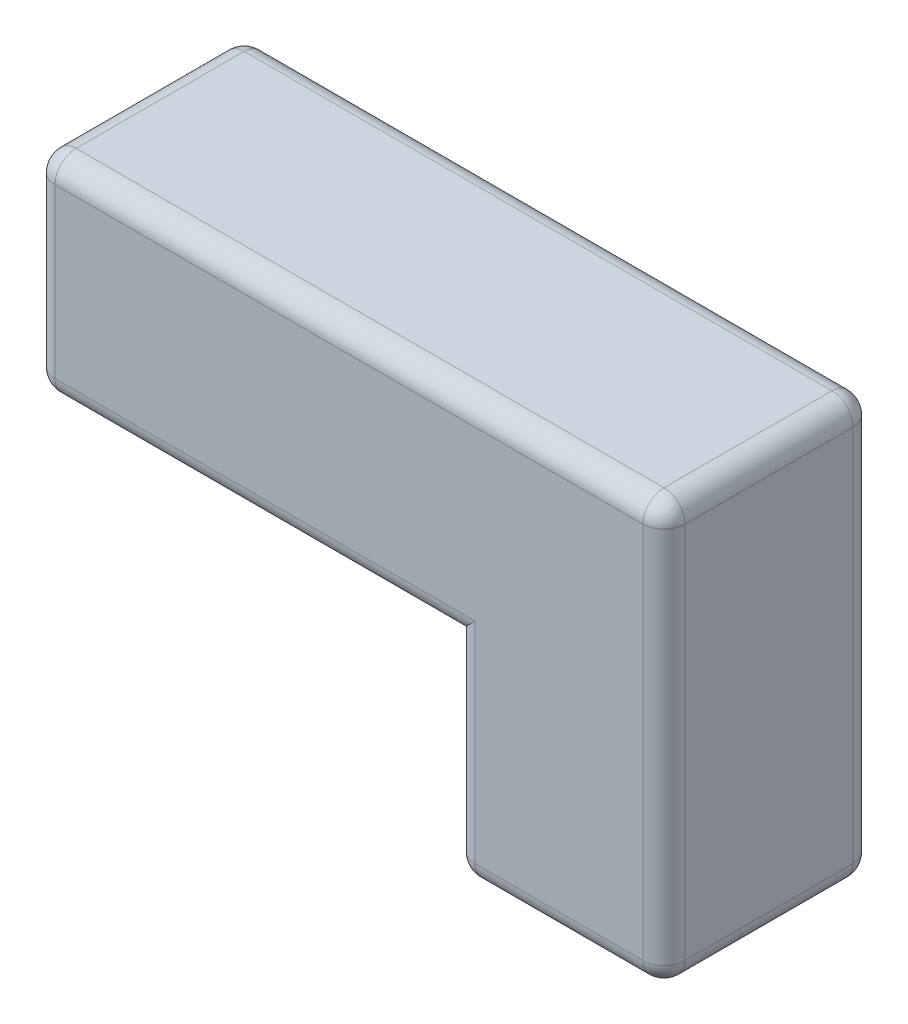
ISO-10303-21;
HEADER;
FILE_DESCRIPTION(('STEP AP214'),'2;1');
FILE_NAME('part.step','',(''),(''),'','','');
FILE_SCHEMA(('AUTOMOTIVE_DESIGN { 1 0 10303 214 1 1 1 1 }'));
ENDSEC;
DATA;
#1=APPLICATION_CONTEXT('core data for automotive mechanical design processes');
#2=APPLICATION_PROTOCOL_DEFINITION('international standard','automotive_design',2000,#1);
#3=PRODUCT_CONTEXT('',#1,'mechanical');
#4=PRODUCT('Part','Part','',(#3));
#5=PRODUCT_RELATED_PRODUCT_CATEGORY('part','',(#4));
#6=PRODUCT_DEFINITION_FORMATION('','',#4);
#7=PRODUCT_DEFINITION_CONTEXT('part definition',#1,'design');
#8=PRODUCT_DEFINITION('design','',#6,#7);
#9=PRODUCT_DEFINITION_SHAPE('','',#8);
#10=(LENGTH_UNIT() NAMED_UNIT(*) SI_UNIT(.MILLI.,.METRE.));
#11=(NAMED_UNIT(*) PLANE_ANGLE_UNIT() SI_UNIT($,.RADIAN.));
#12=(NAMED_UNIT(*) SI_UNIT($,.STERADIAN.) SOLID_ANGLE_UNIT());
#13=UNCERTAINTY_MEASURE_WITH_UNIT(LENGTH_MEASURE(1.E-05),#10,'distance_accuracy_value','');
#14=(GEOMETRIC_REPRESENTATION_CONTEXT(3) GLOBAL_UNCERTAINTY_ASSIGNED_CONTEXT((#13)) GLOBAL_UNIT_ASSIGNED_CONTEXT((#10,
#11,#12)) REPRESENTATION_CONTEXT('',''));
#15=CARTESIAN_POINT('',(0.,0.,0.));
#16=DIRECTION('',(0.,0.,1.));
#17=DIRECTION('',(1.,0.,0.));
#18=AXIS2_PLACEMENT_3D('',#15,#16,#17);
#19=CARTESIAN_POINT('',(-326.4,114.74031182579,100.));
#20=DIRECTION('',(1.,0.,0.));
#21=DIRECTION('',(0.,1.,0.));
#22=AXIS2_PLACEMENT_3D('',#19,#20,#21);
#23=PLANE('',#22);
#24=DIRECTION('',(0.,-1.,0.));
#25=VECTOR('',#24,1.);
#26=CARTESIAN_POINT('',(-326.4,114.74031182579,9.99999999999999));
#27=LINE('',#26,#25);
#28=CARTESIAN_POINT('',(-326.4,104.74031182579,9.99999999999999));
#29=VERTEX_POINT('',#28);
#30=CARTESIAN_POINT('',(-326.4,24.7403118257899,9.99999999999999));
#31=VERTEX_POINT('',#30);
#32=EDGE_CURVE('E216',#29,#31,#27,.T.);
#33=ORIENTED_EDGE('',*,*,#32,.T.);
#34=DIRECTION('',(0.,0.,-1.));
#35=VECTOR('',#34,1.);
#36=CARTESIAN_POINT('',(-326.4,24.7403118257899,100.));
#37=LINE('',#36,#35);
#38=CARTESIAN_POINT('',(-326.4,24.7403118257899,90.));
#39=VERTEX_POINT('',#38);
#40=EDGE_CURVE('E218',#31,#39,#37,.F.);
#41=ORIENTED_EDGE('',*,*,#40,.T.);
#42=DIRECTION('',(0.,-1.,0.));
#43=VECTOR('',#42,1.);
#44=CARTESIAN_POINT('',(-326.4,114.74031182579,90.));
#45=LINE('',#44,#43);
#46=CARTESIAN_POINT('',(-326.4,104.74031182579,90.));
#47=VERTEX_POINT('',#46);
#48=EDGE_CURVE('E212',#39,#47,#45,.F.);
#49=ORIENTED_EDGE('',*,*,#48,.T.);
#50=DIRECTION('',(0.,0.,-1.));
#51=VECTOR('',#50,1.);
#52=CARTESIAN_POINT('',(-326.4,104.74031182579,100.));
#53=LINE('',#52,#51);
#54=EDGE_CURVE('E214',#47,#29,#53,.T.);
#55=ORIENTED_EDGE('',*,*,#54,.T.);
#56=EDGE_LOOP('',(#33,#41,#49,#55));
#57=FACE_BOUND('',#56,.T.);
#58=ADVANCED_FACE('F37',(#57),#23,.F.);
#59=CARTESIAN_POINT('',(-326.4,14.7403118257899,100.));
#60=DIRECTION('',(0.,1.,0.));
#61=DIRECTION('',(-1.,0.,0.));
#62=AXIS2_PLACEMENT_3D('',#59,#60,#61);
#63=PLANE('',#62);
#64=DIRECTION('',(0.,0.,-1.));
#65=VECTOR('',#64,1.);
#66=CARTESIAN_POINT('',(-316.4,14.7403118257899,100.));
#67=LINE('',#66,#65);
#68=CARTESIAN_POINT('',(-316.4,14.7403118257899,90.));
#69=VERTEX_POINT('',#68);
#70=CARTESIAN_POINT('',(-316.4,14.7403118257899,9.99999999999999));
#71=VERTEX_POINT('',#70);
#72=EDGE_CURVE('E208',#69,#71,#67,.T.);
#73=ORIENTED_EDGE('',*,*,#72,.T.);
#74=DIRECTION('',(1.,0.,0.));
#75=VECTOR('',#74,1.);
#76=CARTESIAN_POINT('',(-326.4,14.7403118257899,9.99999999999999));
#77=LINE('',#76,#75);
#78=CARTESIAN_POINT('',(-126.4,14.7403118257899,9.99999999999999));
#79=VERTEX_POINT('',#78);
#80=EDGE_CURVE('E210',#71,#79,#77,.T.);
#81=ORIENTED_EDGE('',*,*,#80,.T.);
#82=DIRECTION('',(0.,0.,-1.));
#83=VECTOR('',#82,1.);
#84=CARTESIAN_POINT('',(-126.4,14.7403118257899,100.));
#85=LINE('',#84,#83);
#86=CARTESIAN_POINT('',(-126.4,14.7403118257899,90.));
#87=VERTEX_POINT('',#86);
#88=EDGE_CURVE('E191',#87,#79,#85,.T.);
#89=ORIENTED_EDGE('',*,*,#88,.F.);
#90=DIRECTION('',(1.,0.,0.));
#91=VECTOR('',#90,1.);
#92=CARTESIAN_POINT('',(-326.4,14.7403118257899,90.));
#93=LINE('',#92,#91);
#94=EDGE_CURVE('E206',#87,#69,#93,.F.);
#95=ORIENTED_EDGE('',*,*,#94,.T.);
#96=EDGE_LOOP('',(#73,#81,#89,#95));
#97=FACE_BOUND('',#96,.T.);
#98=ADVANCED_FACE('F433',(#97),#63,.F.);
#99=CARTESIAN_POINT('',(-126.4,14.7403118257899,100.));
#100=DIRECTION('',(1.,0.,0.));
#101=DIRECTION('',(0.,0.,-1.));
#102=AXIS2_PLACEMENT_3D('',#99,#100,#101);
#103=PLANE('',#102);
#104=ORIENTED_EDGE('',*,*,#88,.T.);
#105=DIRECTION('',(0.,-1.,0.));
#106=VECTOR('',#105,1.);
#107=CARTESIAN_POINT('',(-126.4,14.7403118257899,9.99999999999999));
#108=LINE('',#107,#106);
#109=CARTESIAN_POINT('',(-126.4,-75.2596881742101,9.99999999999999));
#110=VERTEX_POINT('',#109);
#111=EDGE_CURVE('E204',#79,#110,#108,.T.);
#112=ORIENTED_EDGE('',*,*,#111,.T.);
#113=DIRECTION('',(0.,0.,-1.));
#114=VECTOR('',#113,1.);
#115=CARTESIAN_POINT('',(-126.4,-75.2596881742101,100.));
#116=LINE('',#115,#114);
#117=CARTESIAN_POINT('',(-126.4,-75.2596881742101,90.));
#118=VERTEX_POINT('',#117);
#119=EDGE_CURVE('E201',#110,#118,#116,.F.);
#120=ORIENTED_EDGE('',*,*,#119,.T.);
#121=DIRECTION('',(0.,-1.,0.));
#122=VECTOR('',#121,1.);
#123=CARTESIAN_POINT('',(-126.4,14.7403118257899,90.));
#124=LINE('',#123,#122);
#125=EDGE_CURVE('E199',#118,#87,#124,.F.);
#126=ORIENTED_EDGE('',*,*,#125,.T.);
#127=EDGE_LOOP('',(#104,#112,#120,#126));
#128=FACE_BOUND('',#127,.T.);
#129=ADVANCED_FACE('F438',(#128),#103,.F.);
#130=CARTESIAN_POINT('',(-26.4,-85.2596881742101,100.));
#131=DIRECTION('',(0.,1.,0.));
#132=DIRECTION('',(-1.,0.,0.));
#133=AXIS2_PLACEMENT_3D('',#130,#131,#132);
#134=PLANE('',#133);
#135=DIRECTION('',(1.,0.,0.));
#136=VECTOR('',#135,1.);
#137=CARTESIAN_POINT('',(-126.4,-85.2596881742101,90.));
#138=LINE('',#137,#136);
#139=CARTESIAN_POINT('',(-36.4,-85.2596881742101,90.));
#140=VERTEX_POINT('',#139);
#141=CARTESIAN_POINT('',(-116.4,-85.2596881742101,90.));
#142=VERTEX_POINT('',#141);
#143=EDGE_CURVE('E159',#140,#142,#138,.F.);
#144=ORIENTED_EDGE('',*,*,#143,.T.);
#145=DIRECTION('',(0.,0.,-1.));
#146=VECTOR('',#145,1.);
#147=CARTESIAN_POINT('',(-116.4,-85.2596881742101,100.));
#148=LINE('',#147,#146);
#149=CARTESIAN_POINT('',(-116.4,-85.2596881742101,9.99999999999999));
#150=VERTEX_POINT('',#149);
#151=EDGE_CURVE('E197',#142,#150,#148,.T.);
#152=ORIENTED_EDGE('',*,*,#151,.T.);
#153=DIRECTION('',(1.,0.,0.));
#154=VECTOR('',#153,1.);
#155=CARTESIAN_POINT('',(-26.4,-85.2596881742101,9.99999999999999));
#156=LINE('',#155,#154);
#157=CARTESIAN_POINT('',(-36.4,-85.2596881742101,9.99999999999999));
#158=VERTEX_POINT('',#157);
#159=EDGE_CURVE('E162',#150,#158,#156,.T.);
#160=ORIENTED_EDGE('',*,*,#159,.T.);
#161=DIRECTION('',(0.,0.,-1.));
#162=VECTOR('',#161,1.);
#163=CARTESIAN_POINT('',(-36.4,-85.2596881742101,100.));
#164=LINE('',#163,#162);
#165=EDGE_CURVE('E154',#158,#140,#164,.F.);
#166=ORIENTED_EDGE('',*,*,#165,.T.);
#167=EDGE_LOOP('',(#144,#152,#160,#166));
#168=FACE_BOUND('',#167,.T.);
#169=ADVANCED_FACE('F156',(#168),#134,.F.);
#170=CARTESIAN_POINT('',(-26.4,114.74031182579,100.));
#171=DIRECTION('',(-1.,0.,0.));
#172=DIRECTION('',(0.,-1.,0.));
#173=AXIS2_PLACEMENT_3D('',#170,#171,#172);
#174=PLANE('',#173);
#175=DIRECTION('',(0.,1.,0.));
#176=VECTOR('',#175,1.);
#177=CARTESIAN_POINT('',(-26.4,-85.2596881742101,90.));
#178=LINE('',#177,#176);
#179=CARTESIAN_POINT('',(-26.4,104.74031182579,90.));
#180=VERTEX_POINT('',#179);
#181=CARTESIAN_POINT('',(-26.4,-75.2596881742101,90.));
#182=VERTEX_POINT('',#181);
#183=EDGE_CURVE('E234',#180,#182,#178,.F.);
#184=ORIENTED_EDGE('',*,*,#183,.T.);
#185=DIRECTION('',(0.,0.,-1.));
#186=VECTOR('',#185,1.);
#187=CARTESIAN_POINT('',(-26.4,-75.2596881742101,100.));
#188=LINE('',#187,#186);
#189=CARTESIAN_POINT('',(-26.4,-75.2596881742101,9.99999999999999));
#190=VERTEX_POINT('',#189);
#191=EDGE_CURVE('E173',#182,#190,#188,.T.);
#192=ORIENTED_EDGE('',*,*,#191,.T.);
#193=DIRECTION('',(0.,1.,0.));
#194=VECTOR('',#193,1.);
#195=CARTESIAN_POINT('',(-26.4,114.74031182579,9.99999999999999));
#196=LINE('',#195,#194);
#197=CARTESIAN_POINT('',(-26.4,104.74031182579,9.99999999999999));
#198=VERTEX_POINT('',#197);
#199=EDGE_CURVE('E238',#190,#198,#196,.T.);
#200=ORIENTED_EDGE('',*,*,#199,.T.);
#201=DIRECTION('',(0.,0.,-1.));
#202=VECTOR('',#201,1.);
#203=CARTESIAN_POINT('',(-26.4,104.74031182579,100.));
#204=LINE('',#203,#202);
#205=EDGE_CURVE('E236',#198,#180,#204,.F.);
#206=ORIENTED_EDGE('',*,*,#205,.T.);
#207=EDGE_LOOP('',(#184,#192,#200,#206));
#208=FACE_BOUND('',#207,.T.);
#209=ADVANCED_FACE('F358',(#208),#174,.F.);
#210=CARTESIAN_POINT('',(-326.4,114.74031182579,100.));
#211=DIRECTION('',(0.,-1.,0.));
#212=DIRECTION('',(0.,0.,-1.));
#213=AXIS2_PLACEMENT_3D('',#210,#211,#212);
#214=PLANE('',#213);
#215=DIRECTION('',(0.,0.,-1.));
#216=VECTOR('',#215,1.);
#217=CARTESIAN_POINT('',(-36.4,114.74031182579,100.));
#218=LINE('',#217,#216);
#219=CARTESIAN_POINT('',(-36.4,114.74031182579,90.));
#220=VERTEX_POINT('',#219);
#221=CARTESIAN_POINT('',(-36.4,114.74031182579,9.99999999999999));
#222=VERTEX_POINT('',#221);
#223=EDGE_CURVE('E245',#220,#222,#218,.T.);
#224=ORIENTED_EDGE('',*,*,#223,.T.);
#225=DIRECTION('',(-1.,0.,0.));
#226=VECTOR('',#225,1.);
#227=CARTESIAN_POINT('',(-326.4,114.74031182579,9.99999999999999));
#228=LINE('',#227,#226);
#229=CARTESIAN_POINT('',(-316.4,114.74031182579,9.99999999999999));
#230=VERTEX_POINT('',#229);
#231=EDGE_CURVE('E248',#222,#230,#228,.T.);
#232=ORIENTED_EDGE('',*,*,#231,.T.);
#233=DIRECTION('',(0.,0.,-1.));
#234=VECTOR('',#233,1.);
#235=CARTESIAN_POINT('',(-316.4,114.74031182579,100.));
#236=LINE('',#235,#234);
#237=CARTESIAN_POINT('',(-316.4,114.74031182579,90.));
#238=VERTEX_POINT('',#237);
#239=EDGE_CURVE('E243',#230,#238,#236,.F.);
#240=ORIENTED_EDGE('',*,*,#239,.T.);
#241=DIRECTION('',(-1.,0.,0.));
#242=VECTOR('',#241,1.);
#243=CARTESIAN_POINT('',(-26.4,114.74031182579,90.));
#244=LINE('',#243,#242);
#245=EDGE_CURVE('E241',#238,#220,#244,.F.);
#246=ORIENTED_EDGE('',*,*,#245,.T.);
#247=EDGE_LOOP('',(#224,#232,#240,#246));
#248=FACE_BOUND('',#247,.T.);
#249=ADVANCED_FACE('F367',(#248),#214,.F.);
#250=CARTESIAN_POINT('',(0.,0.,100.));
#251=DIRECTION('',(0.,0.,1.));
#252=DIRECTION('',(1.,0.,0.));
#253=AXIS2_PLACEMENT_3D('',#250,#251,#252);
#254=PLANE('',#253);
#255=DIRECTION('',(0.,1.,0.));
#256=VECTOR('',#255,1.);
#257=CARTESIAN_POINT('',(-36.4,114.74031182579,100.));
#258=LINE('',#257,#256);
#259=CARTESIAN_POINT('',(-36.4,-75.2596881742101,100.));
#260=VERTEX_POINT('',#259);
#261=CARTESIAN_POINT('',(-36.4,104.74031182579,100.));
#262=VERTEX_POINT('',#261);
#263=EDGE_CURVE('E46',#260,#262,#258,.T.);
#264=ORIENTED_EDGE('',*,*,#263,.T.);
#265=DIRECTION('',(-1.,0.,0.));
#266=VECTOR('',#265,1.);
#267=CARTESIAN_POINT('',(-326.4,104.74031182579,100.));
#268=LINE('',#267,#266);
#269=CARTESIAN_POINT('',(-316.4,104.74031182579,100.));
#270=VERTEX_POINT('',#269);
#271=EDGE_CURVE('E11',#262,#270,#268,.T.);
#272=ORIENTED_EDGE('',*,*,#271,.T.);
#273=DIRECTION('',(0.,-1.,0.));
#274=VECTOR('',#273,1.);
#275=CARTESIAN_POINT('',(-316.4,14.7403118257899,100.));
#276=LINE('',#275,#274);
#277=CARTESIAN_POINT('',(-316.4,24.7403118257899,100.));
#278=VERTEX_POINT('',#277);
#279=EDGE_CURVE('E250',#270,#278,#276,.T.);
#280=ORIENTED_EDGE('',*,*,#279,.T.);
#281=DIRECTION('',(1.,0.,0.));
#282=VECTOR('',#281,1.);
#283=CARTESIAN_POINT('',(-126.4,24.7403118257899,100.));
#284=LINE('',#283,#282);
#285=CARTESIAN_POINT('',(-116.4,24.7403118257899,100.));
#286=VERTEX_POINT('',#285);
#287=EDGE_CURVE('E252',#278,#286,#284,.T.);
#288=ORIENTED_EDGE('',*,*,#287,.T.);
#289=DIRECTION('',(0.,-1.,0.));
#290=VECTOR('',#289,1.);
#291=CARTESIAN_POINT('',(-116.4,-85.2596881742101,100.));
#292=LINE('',#291,#290);
#293=CARTESIAN_POINT('',(-116.4,-75.2596881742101,100.));
#294=VERTEX_POINT('',#293);
#295=EDGE_CURVE('E254',#286,#294,#292,.T.);
#296=ORIENTED_EDGE('',*,*,#295,.T.);
#297=DIRECTION('',(1.,0.,0.));
#298=VECTOR('',#297,1.);
#299=CARTESIAN_POINT('',(-26.4,-75.2596881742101,100.));
#300=LINE('',#299,#298);
#301=EDGE_CURVE('E57',#294,#260,#300,.T.);
#302=ORIENTED_EDGE('',*,*,#301,.T.);
#303=EDGE_LOOP('',(#264,#272,#280,#288,#296,#302));
#304=FACE_BOUND('',#303,.T.);
#305=ADVANCED_FACE('F345',(#304),#254,.T.);
#306=CARTESIAN_POINT('',(0.,0.,0.));
#307=DIRECTION('',(0.,0.,1.));
#308=DIRECTION('',(1.,0.,0.));
#309=AXIS2_PLACEMENT_3D('',#306,#307,#308);
#310=PLANE('',#309);
#311=DIRECTION('',(0.,-1.,0.));
#312=VECTOR('',#311,1.);
#313=CARTESIAN_POINT('',(-116.4,0.,0.));
#314=LINE('',#313,#312);
#315=CARTESIAN_POINT('',(-116.4,-75.2596881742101,0.));
#316=VERTEX_POINT('',#315);
#317=CARTESIAN_POINT('',(-116.4,24.7403118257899,0.));
#318=VERTEX_POINT('',#317);
#319=EDGE_CURVE('E229',#316,#318,#314,.F.);
#320=ORIENTED_EDGE('',*,*,#319,.T.);
#321=DIRECTION('',(1.,0.,0.));
#322=VECTOR('',#321,1.);
#323=CARTESIAN_POINT('',(0.,24.7403118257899,0.));
#324=LINE('',#323,#322);
#325=CARTESIAN_POINT('',(-316.4,24.7403118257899,0.));
#326=VERTEX_POINT('',#325);
#327=EDGE_CURVE('E231',#318,#326,#324,.F.);
#328=ORIENTED_EDGE('',*,*,#327,.T.);
#329=DIRECTION('',(0.,-1.,0.));
#330=VECTOR('',#329,1.);
#331=CARTESIAN_POINT('',(-316.4,-3.51274564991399E-13,0.));
#332=LINE('',#331,#330);
#333=CARTESIAN_POINT('',(-316.4,104.74031182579,0.));
#334=VERTEX_POINT('',#333);
#335=EDGE_CURVE('E225',#326,#334,#332,.F.);
#336=ORIENTED_EDGE('',*,*,#335,.T.);
#337=DIRECTION('',(-1.,0.,0.));
#338=VECTOR('',#337,1.);
#339=CARTESIAN_POINT('',(0.,104.74031182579,0.));
#340=LINE('',#339,#338);
#341=CARTESIAN_POINT('',(-36.4,104.74031182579,0.));
#342=VERTEX_POINT('',#341);
#343=EDGE_CURVE('E221',#334,#342,#340,.F.);
#344=ORIENTED_EDGE('',*,*,#343,.T.);
#345=DIRECTION('',(0.,1.,0.));
#346=VECTOR('',#345,1.);
#347=CARTESIAN_POINT('',(-36.4,0.,0.));
#348=LINE('',#347,#346);
#349=CARTESIAN_POINT('',(-36.4,-75.2596881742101,0.));
#350=VERTEX_POINT('',#349);
#351=EDGE_CURVE('E223',#342,#350,#348,.F.);
#352=ORIENTED_EDGE('',*,*,#351,.T.);
#353=DIRECTION('',(1.,0.,0.));
#354=VECTOR('',#353,1.);
#355=CARTESIAN_POINT('',(0.,-75.2596881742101,0.));
#356=LINE('',#355,#354);
#357=EDGE_CURVE('E227',#350,#316,#356,.F.);
#358=ORIENTED_EDGE('',*,*,#357,.T.);
#359=EDGE_LOOP('',(#320,#328,#336,#344,#352,#358));
#360=FACE_BOUND('',#359,.T.);
#361=ADVANCED_FACE('F646',(#360),#310,.F.);
#362=CARTESIAN_POINT('',(-316.4,104.74031182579,100.));
#363=DIRECTION('',(0.,0.,-1.));
#364=DIRECTION('',(-1.,0.,0.));
#365=AXIS2_PLACEMENT_3D('',#362,#363,#364);
#366=CYLINDRICAL_SURFACE('',#365,10.);
#367=CARTESIAN_POINT('',(-316.4,104.74031182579,90.));
#368=DIRECTION('',(0.,0.,1.));
#369=DIRECTION('',(1.,0.,0.));
#370=AXIS2_PLACEMENT_3D('',#367,#368,#369);
#371=CIRCLE('',#370,10.);
#372=EDGE_CURVE('E41',#238,#47,#371,.T.);
#373=ORIENTED_EDGE('',*,*,#372,.F.);
#374=ORIENTED_EDGE('',*,*,#239,.F.);
#375=CARTESIAN_POINT('',(-316.4,104.74031182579,9.99999999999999));
#376=DIRECTION('',(0.,0.,-1.));
#377=DIRECTION('',(-1.,0.,0.));
#378=AXIS2_PLACEMENT_3D('',#375,#376,#377);
#379=CIRCLE('',#378,10.);
#380=EDGE_CURVE('E322',#29,#230,#379,.T.);
#381=ORIENTED_EDGE('',*,*,#380,.F.);
#382=ORIENTED_EDGE('',*,*,#54,.F.);
#383=EDGE_LOOP('',(#373,#374,#381,#382));
#384=FACE_BOUND('',#383,.T.);
#385=ADVANCED_FACE('F39',(#384),#366,.T.);
#386=CARTESIAN_POINT('',(-316.4,104.74031182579,90.));
#387=DIRECTION('',(0.,0.,1.));
#388=DIRECTION('',(1.,0.,0.));
#389=AXIS2_PLACEMENT_3D('',#386,#387,#388);
#390=SPHERICAL_SURFACE('',#389,10.);
#391=CARTESIAN_POINT('',(-316.4,104.74031182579,90.));
#392=DIRECTION('',(0.,1.,0.));
#393=DIRECTION('',(-1.,0.,0.));
#394=AXIS2_PLACEMENT_3D('',#391,#392,#393);
#395=CIRCLE('',#394,10.);
#396=EDGE_CURVE('E319',#270,#47,#395,.F.);
#397=ORIENTED_EDGE('',*,*,#396,.F.);
#398=CARTESIAN_POINT('',(-316.4,104.74031182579,90.));
#399=DIRECTION('',(-1.,0.,0.));
#400=DIRECTION('',(0.,0.,1.));
#401=AXIS2_PLACEMENT_3D('',#398,#399,#400);
#402=CIRCLE('',#401,10.);
#403=EDGE_CURVE('E327',#238,#270,#402,.F.);
#404=ORIENTED_EDGE('',*,*,#403,.F.);
#405=ORIENTED_EDGE('',*,*,#372,.T.);
#406=EDGE_LOOP('',(#397,#404,#405));
#407=FACE_BOUND('',#406,.T.);
#408=ADVANCED_FACE('F336',(#407),#390,.T.);
#409=CARTESIAN_POINT('',(0.,104.74031182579,90.));
#410=DIRECTION('',(1.,0.,0.));
#411=DIRECTION('',(0.,0.,-1.));
#412=AXIS2_PLACEMENT_3D('',#409,#410,#411);
#413=CYLINDRICAL_SURFACE('',#412,10.);
#414=ORIENTED_EDGE('',*,*,#403,.T.);
#415=ORIENTED_EDGE('',*,*,#271,.F.);
#416=CARTESIAN_POINT('',(-36.4,104.74031182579,90.));
#417=DIRECTION('',(1.,0.,0.));
#418=DIRECTION('',(0.,0.,-1.));
#419=AXIS2_PLACEMENT_3D('',#416,#417,#418);
#420=CIRCLE('',#419,10.);
#421=EDGE_CURVE('E316',#220,#262,#420,.T.);
#422=ORIENTED_EDGE('',*,*,#421,.F.);
#423=ORIENTED_EDGE('',*,*,#245,.F.);
#424=EDGE_LOOP('',(#414,#415,#422,#423));
#425=FACE_BOUND('',#424,.T.);
#426=ADVANCED_FACE('F349',(#425),#413,.T.);
#427=CARTESIAN_POINT('',(-36.4,104.74031182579,100.));
#428=DIRECTION('',(0.,0.,-1.));
#429=DIRECTION('',(-1.,0.,0.));
#430=AXIS2_PLACEMENT_3D('',#427,#428,#429);
#431=CYLINDRICAL_SURFACE('',#430,10.);
#432=CARTESIAN_POINT('',(-36.4,104.74031182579,9.99999999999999));
#433=DIRECTION('',(0.,0.,-1.));
#434=DIRECTION('',(-1.,0.,0.));
#435=AXIS2_PLACEMENT_3D('',#432,#433,#434);
#436=CIRCLE('',#435,10.);
#437=EDGE_CURVE('E310',#222,#198,#436,.T.);
#438=ORIENTED_EDGE('',*,*,#437,.F.);
#439=ORIENTED_EDGE('',*,*,#223,.F.);
#440=CARTESIAN_POINT('',(-36.4,104.74031182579,90.));
#441=DIRECTION('',(0.,0.,1.));
#442=DIRECTION('',(1.,0.,0.));
#443=AXIS2_PLACEMENT_3D('',#440,#441,#442);
#444=CIRCLE('',#443,10.);
#445=EDGE_CURVE('E313',#180,#220,#444,.T.);
#446=ORIENTED_EDGE('',*,*,#445,.F.);
#447=ORIENTED_EDGE('',*,*,#205,.F.);
#448=EDGE_LOOP('',(#438,#439,#446,#447));
#449=FACE_BOUND('',#448,.T.);
#450=ADVANCED_FACE('F364',(#449),#431,.T.);
#451=CARTESIAN_POINT('',(-326.4,104.74031182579,9.99999999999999));
#452=DIRECTION('',(-1.,0.,0.));
#453=DIRECTION('',(0.,0.,1.));
#454=AXIS2_PLACEMENT_3D('',#451,#452,#453);
#455=CYLINDRICAL_SURFACE('',#454,10.);
#456=CARTESIAN_POINT('',(-316.4,104.74031182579,9.99999999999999));
#457=DIRECTION('',(-1.,0.,0.));
#458=DIRECTION('',(0.,0.,1.));
#459=AXIS2_PLACEMENT_3D('',#456,#457,#458);
#460=CIRCLE('',#459,10.);
#461=EDGE_CURVE('E325',#230,#334,#460,.T.);
#462=ORIENTED_EDGE('',*,*,#461,.F.);
#463=ORIENTED_EDGE('',*,*,#231,.F.);
#464=CARTESIAN_POINT('',(-36.4,104.74031182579,10.));
#465=DIRECTION('',(1.,0.,0.));
#466=DIRECTION('',(0.,1.,0.));
#467=AXIS2_PLACEMENT_3D('',#464,#465,#466);
#468=CIRCLE('',#467,10.);
#469=EDGE_CURVE('E308',#342,#222,#468,.T.);
#470=ORIENTED_EDGE('',*,*,#469,.F.);
#471=ORIENTED_EDGE('',*,*,#343,.F.);
#472=EDGE_LOOP('',(#462,#463,#470,#471));
#473=FACE_BOUND('',#472,.T.);
#474=ADVANCED_FACE('F373',(#473),#455,.T.);
#475=CARTESIAN_POINT('',(-316.4,104.74031182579,10.));
#476=DIRECTION('',(0.,0.,1.));
#477=DIRECTION('',(1.,0.,0.));
#478=AXIS2_PLACEMENT_3D('',#475,#476,#477);
#479=SPHERICAL_SURFACE('',#478,10.);
#480=ORIENTED_EDGE('',*,*,#380,.T.);
#481=ORIENTED_EDGE('',*,*,#461,.T.);
#482=CARTESIAN_POINT('',(-316.4,104.74031182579,10.));
#483=DIRECTION('',(0.,1.,0.));
#484=DIRECTION('',(-1.,0.,0.));
#485=AXIS2_PLACEMENT_3D('',#482,#483,#484);
#486=CIRCLE('',#485,10.);
#487=EDGE_CURVE('E305',#29,#334,#486,.F.);
#488=ORIENTED_EDGE('',*,*,#487,.F.);
#489=EDGE_LOOP('',(#480,#481,#488));
#490=FACE_BOUND('',#489,.T.);
#491=ADVANCED_FACE('F376',(#490),#479,.T.);
#492=CARTESIAN_POINT('',(-316.4,-3.51274564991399E-13,90.));
#493=DIRECTION('',(0.,1.,0.));
#494=DIRECTION('',(-1.,0.,0.));
#495=AXIS2_PLACEMENT_3D('',#492,#493,#494);
#496=CYLINDRICAL_SURFACE('',#495,10.);
#497=ORIENTED_EDGE('',*,*,#396,.T.);
#498=ORIENTED_EDGE('',*,*,#48,.F.);
#499=CARTESIAN_POINT('',(-316.4,24.7403118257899,90.));
#500=DIRECTION('',(0.,-1.,0.));
#501=DIRECTION('',(1.,0.,0.));
#502=AXIS2_PLACEMENT_3D('',#499,#500,#501);
#503=CIRCLE('',#502,10.);
#504=EDGE_CURVE('E300',#278,#39,#503,.T.);
#505=ORIENTED_EDGE('',*,*,#504,.F.);
#506=ORIENTED_EDGE('',*,*,#279,.F.);
#507=EDGE_LOOP('',(#497,#498,#505,#506));
#508=FACE_BOUND('',#507,.T.);
#509=ADVANCED_FACE('F342',(#508),#496,.T.);
#510=CARTESIAN_POINT('',(-36.4,104.74031182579,90.));
#511=DIRECTION('',(0.,0.,1.));
#512=DIRECTION('',(1.,0.,0.));
#513=AXIS2_PLACEMENT_3D('',#510,#511,#512);
#514=SPHERICAL_SURFACE('',#513,10.);
#515=ORIENTED_EDGE('',*,*,#445,.T.);
#516=ORIENTED_EDGE('',*,*,#421,.T.);
#517=CARTESIAN_POINT('',(-36.4,104.74031182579,90.));
#518=DIRECTION('',(0.,1.,0.));
#519=DIRECTION('',(0.,0.,1.));
#520=AXIS2_PLACEMENT_3D('',#517,#518,#519);
#521=CIRCLE('',#520,10.);
#522=EDGE_CURVE('E297',#180,#262,#521,.F.);
#523=ORIENTED_EDGE('',*,*,#522,.F.);
#524=EDGE_LOOP('',(#515,#516,#523));
#525=FACE_BOUND('',#524,.T.);
#526=ADVANCED_FACE('F352',(#525),#514,.T.);
#527=CARTESIAN_POINT('',(-36.4,104.74031182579,10.));
#528=DIRECTION('',(0.,0.,1.));
#529=DIRECTION('',(1.,0.,0.));
#530=AXIS2_PLACEMENT_3D('',#527,#528,#529);
#531=SPHERICAL_SURFACE('',#530,10.);
#532=ORIENTED_EDGE('',*,*,#469,.T.);
#533=ORIENTED_EDGE('',*,*,#437,.T.);
#534=CARTESIAN_POINT('',(-36.4,104.74031182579,9.99999999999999));
#535=DIRECTION('',(0.,1.,0.));
#536=DIRECTION('',(0.,0.,1.));
#537=AXIS2_PLACEMENT_3D('',#534,#535,#536);
#538=CIRCLE('',#537,10.);
#539=EDGE_CURVE('E294',#342,#198,#538,.F.);
#540=ORIENTED_EDGE('',*,*,#539,.F.);
#541=EDGE_LOOP('',(#532,#533,#540));
#542=FACE_BOUND('',#541,.T.);
#543=ADVANCED_FACE('F423',(#542),#531,.T.);
#544=CARTESIAN_POINT('',(-316.4,114.74031182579,9.99999999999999));
#545=DIRECTION('',(0.,-1.,0.));
#546=DIRECTION('',(1.,0.,0.));
#547=AXIS2_PLACEMENT_3D('',#544,#545,#546);
#548=CYLINDRICAL_SURFACE('',#547,10.);
#549=ORIENTED_EDGE('',*,*,#487,.T.);
#550=ORIENTED_EDGE('',*,*,#335,.F.);
#551=CARTESIAN_POINT('',(-316.4,24.7403118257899,9.99999999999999));
#552=DIRECTION('',(0.,-1.,0.));
#553=DIRECTION('',(1.,0.,0.));
#554=AXIS2_PLACEMENT_3D('',#551,#552,#553);
#555=CIRCLE('',#554,10.);
#556=EDGE_CURVE('E291',#31,#326,#555,.T.);
#557=ORIENTED_EDGE('',*,*,#556,.F.);
#558=ORIENTED_EDGE('',*,*,#32,.F.);
#559=EDGE_LOOP('',(#549,#550,#557,#558));
#560=FACE_BOUND('',#559,.T.);
#561=ADVANCED_FACE('F381',(#560),#548,.T.);
#562=CARTESIAN_POINT('',(-316.4,24.7403118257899,100.));
#563=DIRECTION('',(0.,0.,-1.));
#564=DIRECTION('',(-1.,0.,0.));
#565=AXIS2_PLACEMENT_3D('',#562,#563,#564);
#566=CYLINDRICAL_SURFACE('',#565,10.);
#567=CARTESIAN_POINT('',(-316.4,24.7403118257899,90.));
#568=DIRECTION('',(0.,0.,1.));
#569=DIRECTION('',(1.,0.,0.));
#570=AXIS2_PLACEMENT_3D('',#567,#568,#569);
#571=CIRCLE('',#570,10.);
#572=EDGE_CURVE('E302',#39,#69,#571,.T.);
#573=ORIENTED_EDGE('',*,*,#572,.F.);
#574=ORIENTED_EDGE('',*,*,#40,.F.);
#575=CARTESIAN_POINT('',(-316.4,24.7403118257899,9.99999999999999));
#576=DIRECTION('',(0.,0.,-1.));
#577=DIRECTION('',(-1.,0.,0.));
#578=AXIS2_PLACEMENT_3D('',#575,#576,#577);
#579=CIRCLE('',#578,10.);
#580=EDGE_CURVE('E288',#71,#31,#579,.T.);
#581=ORIENTED_EDGE('',*,*,#580,.F.);
#582=ORIENTED_EDGE('',*,*,#72,.F.);
#583=EDGE_LOOP('',(#573,#574,#581,#582));
#584=FACE_BOUND('',#583,.T.);
#585=ADVANCED_FACE('F387',(#584),#566,.T.);
#586=CARTESIAN_POINT('',(-316.4,24.7403118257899,90.));
#587=DIRECTION('',(0.,0.,1.));
#588=DIRECTION('',(1.,0.,0.));
#589=AXIS2_PLACEMENT_3D('',#586,#587,#588);
#590=SPHERICAL_SURFACE('',#589,10.);
#591=ORIENTED_EDGE('',*,*,#504,.T.);
#592=ORIENTED_EDGE('',*,*,#572,.T.);
#593=CARTESIAN_POINT('',(-316.4,24.7403118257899,90.));
#594=DIRECTION('',(-1.,0.,0.));
#595=DIRECTION('',(0.,0.,1.));
#596=AXIS2_PLACEMENT_3D('',#593,#594,#595);
#597=CIRCLE('',#596,10.);
#598=EDGE_CURVE('E285',#278,#69,#597,.F.);
#599=ORIENTED_EDGE('',*,*,#598,.F.);
#600=EDGE_LOOP('',(#591,#592,#599));
#601=FACE_BOUND('',#600,.T.);
#602=ADVANCED_FACE('F391',(#601),#590,.T.);
#603=CARTESIAN_POINT('',(-36.4,0.,90.));
#604=DIRECTION('',(0.,-1.,0.));
#605=DIRECTION('',(1.,0.,0.));
#606=AXIS2_PLACEMENT_3D('',#603,#604,#605);
#607=CYLINDRICAL_SURFACE('',#606,10.);
#608=ORIENTED_EDGE('',*,*,#522,.T.);
#609=ORIENTED_EDGE('',*,*,#263,.F.);
#610=CARTESIAN_POINT('',(-36.4,-75.2596881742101,90.));
#611=DIRECTION('',(0.,-1.,0.));
#612=DIRECTION('',(0.,0.,-1.));
#613=AXIS2_PLACEMENT_3D('',#610,#611,#612);
#614=CIRCLE('',#613,10.);
#615=EDGE_CURVE('E177',#182,#260,#614,.T.);
#616=ORIENTED_EDGE('',*,*,#615,.F.);
#617=ORIENTED_EDGE('',*,*,#183,.F.);
#618=EDGE_LOOP('',(#608,#609,#616,#617));
#619=FACE_BOUND('',#618,.T.);
#620=ADVANCED_FACE('F356',(#619),#607,.T.);
#621=CARTESIAN_POINT('',(-36.4,-75.2596881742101,100.));
#622=DIRECTION('',(0.,0.,-1.));
#623=DIRECTION('',(-1.,0.,0.));
#624=AXIS2_PLACEMENT_3D('',#621,#622,#623);
#625=CYLINDRICAL_SURFACE('',#624,10.);
#626=CARTESIAN_POINT('',(-36.4,-75.2596881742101,9.99999999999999));
#627=DIRECTION('',(0.,0.,-1.));
#628=DIRECTION('',(-1.,0.,0.));
#629=AXIS2_PLACEMENT_3D('',#626,#627,#628);
#630=CIRCLE('',#629,10.);
#631=EDGE_CURVE('E178',#190,#158,#630,.T.);
#632=ORIENTED_EDGE('',*,*,#631,.F.);
#633=ORIENTED_EDGE('',*,*,#191,.F.);
#634=CARTESIAN_POINT('',(-36.4,-75.2596881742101,90.));
#635=DIRECTION('',(0.,0.,1.));
#636=DIRECTION('',(1.,0.,0.));
#637=AXIS2_PLACEMENT_3D('',#634,#635,#636);
#638=CIRCLE('',#637,10.);
#639=EDGE_CURVE('E169',#140,#182,#638,.T.);
#640=ORIENTED_EDGE('',*,*,#639,.F.);
#641=ORIENTED_EDGE('',*,*,#165,.F.);
#642=EDGE_LOOP('',(#632,#633,#640,#641));
#643=FACE_BOUND('',#642,.T.);
#644=ADVANCED_FACE('F171',(#643),#625,.T.);
#645=CARTESIAN_POINT('',(-36.4,114.74031182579,9.99999999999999));
#646=DIRECTION('',(0.,1.,0.));
#647=DIRECTION('',(-1.,0.,0.));
#648=AXIS2_PLACEMENT_3D('',#645,#646,#647);
#649=CYLINDRICAL_SURFACE('',#648,10.);
#650=ORIENTED_EDGE('',*,*,#539,.T.);
#651=ORIENTED_EDGE('',*,*,#199,.F.);
#652=CARTESIAN_POINT('',(-36.4,-75.2596881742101,10.));
#653=DIRECTION('',(0.,-1.,0.));
#654=DIRECTION('',(0.,0.,-1.));
#655=AXIS2_PLACEMENT_3D('',#652,#653,#654);
#656=CIRCLE('',#655,10.);
#657=EDGE_CURVE('E281',#350,#190,#656,.T.);
#658=ORIENTED_EDGE('',*,*,#657,.F.);
#659=ORIENTED_EDGE('',*,*,#351,.F.);
#660=EDGE_LOOP('',(#650,#651,#658,#659));
#661=FACE_BOUND('',#660,.T.);
#662=ADVANCED_FACE('F419',(#661),#649,.T.);
#663=CARTESIAN_POINT('',(-316.4,24.7403118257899,10.));
#664=DIRECTION('',(0.,0.,1.));
#665=DIRECTION('',(1.,0.,0.));
#666=AXIS2_PLACEMENT_3D('',#663,#664,#665);
#667=SPHERICAL_SURFACE('',#666,10.);
#668=ORIENTED_EDGE('',*,*,#580,.T.);
#669=ORIENTED_EDGE('',*,*,#556,.T.);
#670=CARTESIAN_POINT('',(-316.4,24.7403118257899,10.));
#671=DIRECTION('',(-1.,0.,0.));
#672=DIRECTION('',(0.,0.,1.));
#673=AXIS2_PLACEMENT_3D('',#670,#671,#672);
#674=CIRCLE('',#673,10.);
#675=EDGE_CURVE('E279',#71,#326,#674,.F.);
#676=ORIENTED_EDGE('',*,*,#675,.F.);
#677=EDGE_LOOP('',(#668,#669,#676));
#678=FACE_BOUND('',#677,.T.);
#679=ADVANCED_FACE('F469',(#678),#667,.T.);
#680=CARTESIAN_POINT('',(0.,24.7403118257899,90.));
#681=DIRECTION('',(-1.,0.,0.));
#682=DIRECTION('',(0.,-1.,0.));
#683=AXIS2_PLACEMENT_3D('',#680,#681,#682);
#684=CYLINDRICAL_SURFACE('',#683,10.);
#685=ORIENTED_EDGE('',*,*,#598,.T.);
#686=ORIENTED_EDGE('',*,*,#94,.F.);
#687=CARTESIAN_POINT('',(-116.4,24.7403118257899,90.));
#688=DIRECTION('',(-0.707106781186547,0.707106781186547,0.));
#689=DIRECTION('',(0.707106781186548,0.707106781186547,0.));
#690=AXIS2_PLACEMENT_3D('',#687,#688,#689);
#691=ELLIPSE('',#690,14.1421356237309,10.);
#692=EDGE_CURVE('E184',#286,#87,#691,.F.);
#693=ORIENTED_EDGE('',*,*,#692,.F.);
#694=ORIENTED_EDGE('',*,*,#287,.F.);
#695=EDGE_LOOP('',(#685,#686,#693,#694));
#696=FACE_BOUND('',#695,.T.);
#697=ADVANCED_FACE('F394',(#696),#684,.T.);
#698=CARTESIAN_POINT('',(-36.4,-75.2596881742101,90.));
#699=DIRECTION('',(0.,0.,1.));
#700=DIRECTION('',(1.,0.,0.));
#701=AXIS2_PLACEMENT_3D('',#698,#699,#700);
#702=SPHERICAL_SURFACE('',#701,10.);
#703=ORIENTED_EDGE('',*,*,#639,.T.);
#704=ORIENTED_EDGE('',*,*,#615,.T.);
#705=CARTESIAN_POINT('',(-36.4,-75.2596881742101,90.));
#706=DIRECTION('',(1.,0.,0.));
#707=DIRECTION('',(0.,0.,-1.));
#708=AXIS2_PLACEMENT_3D('',#705,#706,#707);
#709=CIRCLE('',#708,10.);
#710=EDGE_CURVE('E181',#140,#260,#709,.F.);
#711=ORIENTED_EDGE('',*,*,#710,.F.);
#712=EDGE_LOOP('',(#703,#704,#711));
#713=FACE_BOUND('',#712,.T.);
#714=ADVANCED_FACE('F182',(#713),#702,.T.);
#715=CARTESIAN_POINT('',(-36.4,-75.2596881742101,10.));
#716=DIRECTION('',(0.,0.,1.));
#717=DIRECTION('',(1.,0.,0.));
#718=AXIS2_PLACEMENT_3D('',#715,#716,#717);
#719=SPHERICAL_SURFACE('',#718,10.);
#720=ORIENTED_EDGE('',*,*,#657,.T.);
#721=ORIENTED_EDGE('',*,*,#631,.T.);
#722=CARTESIAN_POINT('',(-36.4,-75.2596881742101,9.99999999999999));
#723=DIRECTION('',(1.,0.,0.));
#724=DIRECTION('',(0.,0.,-1.));
#725=AXIS2_PLACEMENT_3D('',#722,#723,#724);
#726=CIRCLE('',#725,10.);
#727=EDGE_CURVE('E185',#350,#158,#726,.F.);
#728=ORIENTED_EDGE('',*,*,#727,.F.);
#729=EDGE_LOOP('',(#720,#721,#728));
#730=FACE_BOUND('',#729,.T.);
#731=ADVANCED_FACE('F416',(#730),#719,.T.);
#732=CARTESIAN_POINT('',(-326.4,24.7403118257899,9.99999999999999));
#733=DIRECTION('',(1.,0.,0.));
#734=DIRECTION('',(0.,1.,0.));
#735=AXIS2_PLACEMENT_3D('',#732,#733,#734);
#736=CYLINDRICAL_SURFACE('',#735,10.);
#737=ORIENTED_EDGE('',*,*,#675,.T.);
#738=ORIENTED_EDGE('',*,*,#327,.F.);
#739=CARTESIAN_POINT('',(-116.4,24.7403118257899,9.99999999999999));
#740=DIRECTION('',(0.707106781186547,-0.707106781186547,0.));
#741=DIRECTION('',(0.707106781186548,0.707106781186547,0.));
#742=AXIS2_PLACEMENT_3D('',#739,#740,#741);
#743=ELLIPSE('',#742,14.1421356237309,10.);
#744=EDGE_CURVE('E272',#79,#318,#743,.T.);
#745=ORIENTED_EDGE('',*,*,#744,.F.);
#746=ORIENTED_EDGE('',*,*,#80,.F.);
#747=EDGE_LOOP('',(#737,#738,#745,#746));
#748=FACE_BOUND('',#747,.T.);
#749=ADVANCED_FACE('F459',(#748),#736,.T.);
#750=CARTESIAN_POINT('',(-116.4,0.,90.));
#751=DIRECTION('',(0.,1.,0.));
#752=DIRECTION('',(0.,0.,1.));
#753=AXIS2_PLACEMENT_3D('',#750,#751,#752);
#754=CYLINDRICAL_SURFACE('',#753,10.);
#755=ORIENTED_EDGE('',*,*,#692,.T.);
#756=ORIENTED_EDGE('',*,*,#125,.F.);
#757=CARTESIAN_POINT('',(-116.4,-75.2596881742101,90.));
#758=DIRECTION('',(0.,-1.,0.));
#759=DIRECTION('',(0.,0.,-1.));
#760=AXIS2_PLACEMENT_3D('',#757,#758,#759);
#761=CIRCLE('',#760,10.);
#762=EDGE_CURVE('E269',#294,#118,#761,.T.);
#763=ORIENTED_EDGE('',*,*,#762,.F.);
#764=ORIENTED_EDGE('',*,*,#295,.F.);
#765=EDGE_LOOP('',(#755,#756,#763,#764));
#766=FACE_BOUND('',#765,.T.);
#767=ADVANCED_FACE('F399',(#766),#754,.T.);
#768=CARTESIAN_POINT('',(0.,-75.2596881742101,90.));
#769=DIRECTION('',(-1.,0.,0.));
#770=DIRECTION('',(0.,-1.,0.));
#771=AXIS2_PLACEMENT_3D('',#768,#769,#770);
#772=CYLINDRICAL_SURFACE('',#771,10.);
#773=ORIENTED_EDGE('',*,*,#710,.T.);
#774=ORIENTED_EDGE('',*,*,#301,.F.);
#775=CARTESIAN_POINT('',(-116.4,-75.2596881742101,90.));
#776=DIRECTION('',(-1.,0.,0.));
#777=DIRECTION('',(0.,0.,1.));
#778=AXIS2_PLACEMENT_3D('',#775,#776,#777);
#779=CIRCLE('',#778,10.);
#780=EDGE_CURVE('E189',#142,#294,#779,.T.);
#781=ORIENTED_EDGE('',*,*,#780,.F.);
#782=ORIENTED_EDGE('',*,*,#143,.F.);
#783=EDGE_LOOP('',(#773,#774,#781,#782));
#784=FACE_BOUND('',#783,.T.);
#785=ADVANCED_FACE('F187',(#784),#772,.T.);
#786=CARTESIAN_POINT('',(-26.4,-75.2596881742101,9.99999999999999));
#787=DIRECTION('',(1.,0.,0.));
#788=DIRECTION('',(0.,1.,0.));
#789=AXIS2_PLACEMENT_3D('',#786,#787,#788);
#790=CYLINDRICAL_SURFACE('',#789,10.);
#791=ORIENTED_EDGE('',*,*,#727,.T.);
#792=ORIENTED_EDGE('',*,*,#159,.F.);
#793=CARTESIAN_POINT('',(-116.4,-75.2596881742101,10.));
#794=DIRECTION('',(-1.,0.,0.));
#795=DIRECTION('',(0.,0.,1.));
#796=AXIS2_PLACEMENT_3D('',#793,#794,#795);
#797=CIRCLE('',#796,10.);
#798=EDGE_CURVE('E265',#316,#150,#797,.T.);
#799=ORIENTED_EDGE('',*,*,#798,.F.);
#800=ORIENTED_EDGE('',*,*,#357,.F.);
#801=EDGE_LOOP('',(#791,#792,#799,#800));
#802=FACE_BOUND('',#801,.T.);
#803=ADVANCED_FACE('F413',(#802),#790,.T.);
#804=CARTESIAN_POINT('',(-116.4,14.7403118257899,9.99999999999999));
#805=DIRECTION('',(0.,-1.,0.));
#806=DIRECTION('',(0.,0.,-1.));
#807=AXIS2_PLACEMENT_3D('',#804,#805,#806);
#808=CYLINDRICAL_SURFACE('',#807,10.);
#809=ORIENTED_EDGE('',*,*,#744,.T.);
#810=ORIENTED_EDGE('',*,*,#319,.F.);
#811=CARTESIAN_POINT('',(-116.4,-75.2596881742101,9.99999999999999));
#812=DIRECTION('',(0.,-1.,0.));
#813=DIRECTION('',(0.,0.,-1.));
#814=AXIS2_PLACEMENT_3D('',#811,#812,#813);
#815=CIRCLE('',#814,10.);
#816=EDGE_CURVE('E262',#110,#316,#815,.T.);
#817=ORIENTED_EDGE('',*,*,#816,.F.);
#818=ORIENTED_EDGE('',*,*,#111,.F.);
#819=EDGE_LOOP('',(#809,#810,#817,#818));
#820=FACE_BOUND('',#819,.T.);
#821=ADVANCED_FACE('F449',(#820),#808,.T.);
#822=CARTESIAN_POINT('',(-116.4,-75.2596881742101,90.));
#823=DIRECTION('',(0.,0.,1.));
#824=DIRECTION('',(1.,0.,0.));
#825=AXIS2_PLACEMENT_3D('',#822,#823,#824);
#826=SPHERICAL_SURFACE('',#825,10.);
#827=ORIENTED_EDGE('',*,*,#780,.T.);
#828=ORIENTED_EDGE('',*,*,#762,.T.);
#829=CARTESIAN_POINT('',(-116.4,-75.2596881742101,90.));
#830=DIRECTION('',(0.,0.,1.));
#831=DIRECTION('',(1.,0.,0.));
#832=AXIS2_PLACEMENT_3D('',#829,#830,#831);
#833=CIRCLE('',#832,10.);
#834=EDGE_CURVE('E260',#142,#118,#833,.F.);
#835=ORIENTED_EDGE('',*,*,#834,.F.);
#836=EDGE_LOOP('',(#827,#828,#835));
#837=FACE_BOUND('',#836,.T.);
#838=ADVANCED_FACE('F401',(#837),#826,.T.);
#839=CARTESIAN_POINT('',(-116.4,-75.2596881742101,10.));
#840=DIRECTION('',(0.,0.,1.));
#841=DIRECTION('',(1.,0.,0.));
#842=AXIS2_PLACEMENT_3D('',#839,#840,#841);
#843=SPHERICAL_SURFACE('',#842,10.);
#844=ORIENTED_EDGE('',*,*,#816,.T.);
#845=ORIENTED_EDGE('',*,*,#798,.T.);
#846=CARTESIAN_POINT('',(-116.4,-75.2596881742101,9.99999999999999));
#847=DIRECTION('',(0.,0.,-1.));
#848=DIRECTION('',(-1.,0.,0.));
#849=AXIS2_PLACEMENT_3D('',#846,#847,#848);
#850=CIRCLE('',#849,10.);
#851=EDGE_CURVE('E258',#110,#150,#850,.F.);
#852=ORIENTED_EDGE('',*,*,#851,.F.);
#853=EDGE_LOOP('',(#844,#845,#852));
#854=FACE_BOUND('',#853,.T.);
#855=ADVANCED_FACE('F409',(#854),#843,.T.);
#856=CARTESIAN_POINT('',(-116.4,-75.2596881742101,100.));
#857=DIRECTION('',(0.,0.,-1.));
#858=DIRECTION('',(-1.,0.,0.));
#859=AXIS2_PLACEMENT_3D('',#856,#857,#858);
#860=CYLINDRICAL_SURFACE('',#859,10.);
#861=ORIENTED_EDGE('',*,*,#834,.T.);
#862=ORIENTED_EDGE('',*,*,#119,.F.);
#863=ORIENTED_EDGE('',*,*,#851,.T.);
#864=ORIENTED_EDGE('',*,*,#151,.F.);
#865=EDGE_LOOP('',(#861,#862,#863,#864));
#866=FACE_BOUND('',#865,.T.);
#867=ADVANCED_FACE('F405',(#866),#860,.T.);
#868=CLOSED_SHELL('',(#58,#98,#129,#169,#209,#249,#305,#361,#385,#408,#426,#450,#474,#491,#509,
#526,#543,#561,#585,#602,#620,#644,#662,#679,#697,#714,#731,#749,#767,#785,#803,#821,#838,#855,#867));
#869=MANIFOLD_SOLID_BREP('B2',#868);
#870=ADVANCED_BREP_SHAPE_REPRESENTATION('',(#18,#869),#14);
#871=SHAPE_DEFINITION_REPRESENTATION(#9,#870);
ENDSEC;
END-ISO-10303-21;
